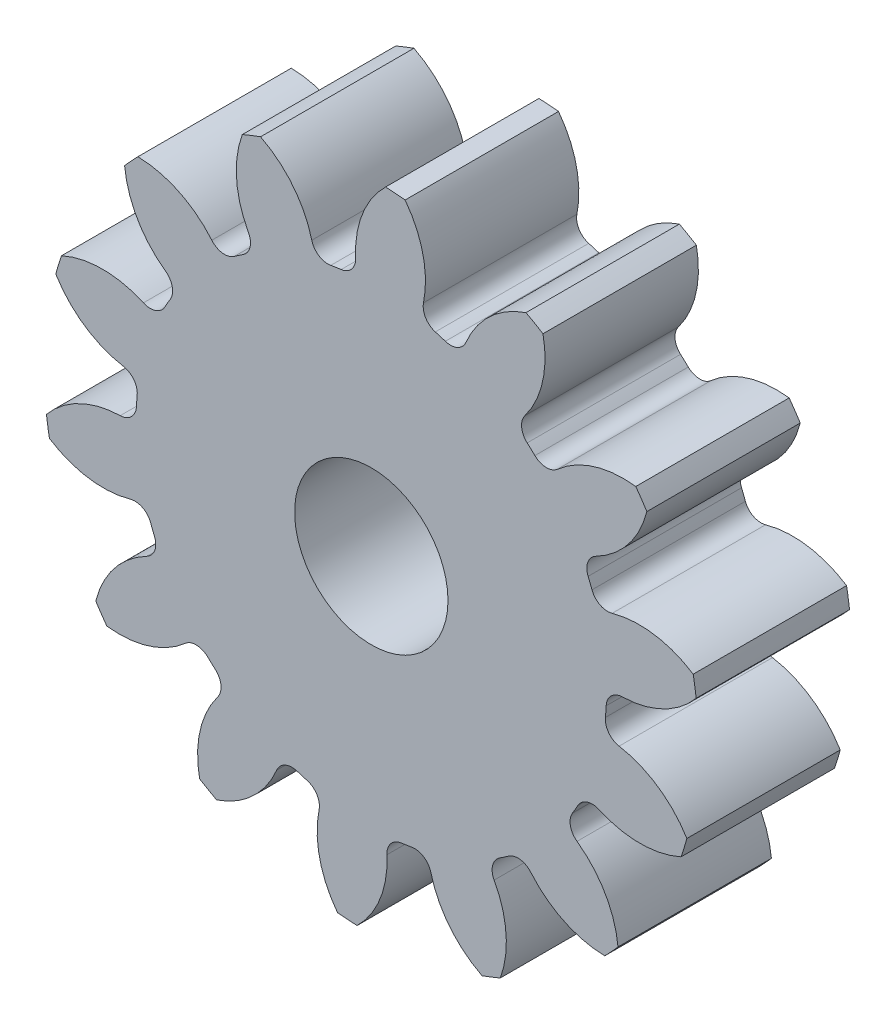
from build123d import *

# Parameters (mm, degrees)
SKETCH3_R         = 270.933333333
GEARBODY_DEPTH    = 127
TOOTHCUT_DEPTH    = 404.656713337
CIRPATTERN1_COUNT = 14
BOREDIA_R         = 63.5
BORE_DEPTH        = 12700


with BuildPart() as part:
    # Sketch3 → gearBody (new body)
    with BuildSketch(Plane.XY):
        Circle(SKETCH3_R)
    extrude(amount=GEARBODY_DEPTH)

    # Sketch2 → toothCut (cut, through all)
    with BuildSketch(Plane.XY):
        with BuildLine():
            ThreePointArc((193.839173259, -18.639904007), (194.206948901, -14.308462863), (194.477948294, -9.969891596))
            ThreePointArc((194.477948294, -9.969891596), (198.623973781, -0.8037071), (207.894381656, 3.103722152))
            ThreePointArc((207.894381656, 3.103722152), (243.035233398, 11.991445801), (270.933333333, 35.13376878))
            ThreePointArc((270.933333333, 35.13376878), (272.463360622, -20.074111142), (262.858742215, -74.461630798))
            ThreePointArc((262.858742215, -74.461630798), (238.653554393, -47.480526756), (205.194706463, -33.538626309))
            ThreePointArc((205.194706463, -33.538626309), (196.59706049, -28.314743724), (193.839173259, -18.639904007))
        make_face()
    toothcut = extrude(amount=TOOTHCUT_DEPTH, mode=Mode.SUBTRACT)

    # CirPattern1: toothCut ×14 about axis
    cirpattern1_axis = Axis((0, 0, 0), (0, 0, 1))
    for i in range(1, CIRPATTERN1_COUNT):
        add(toothcut.rotate(cirpattern1_axis, i * 360 / CIRPATTERN1_COUNT), mode=Mode.SUBTRACT)

    # boreDia → bore (cut, symmetric)
    with BuildSketch(Plane.XY):
        Circle(BOREDIA_R)
    extrude(amount=BORE_DEPTH, both=True, mode=Mode.SUBTRACT)


solid = part.part
